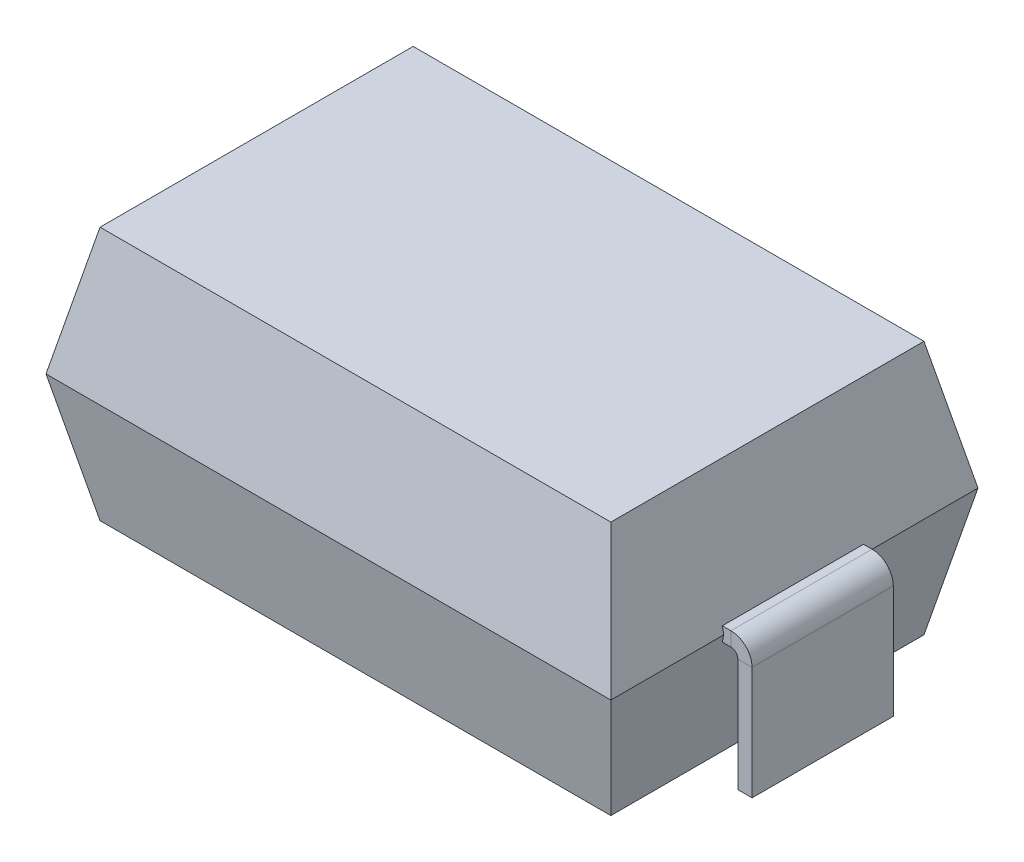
from build123d import *

# Parameters (mm, degrees)
SKETCH1_W            = 4
SKETCH1_H            = 2.6
MB_DEPTH             = 0.9
MB_TAPER             = 12
MB_OTHER_WAY_DEPTH   = 0.9
MB_OTHER_WAY_TAPER   = 12
SKETCH3_W            = 1
SKETCH3_H            = 0.1
SKETCH4_W            = 1
SKETCH4_H            = 0.1
LEG_COMPLETION_DEPTH = 0.010628


with BuildPart() as part:
    # Sketch1 → MB (new body)
    with BuildSketch(Plane(origin=(0, 0, 0), x_dir=(1, 0, 0), z_dir=(0, 1, 0))):
        Rectangle(SKETCH1_W, SKETCH1_H)
    extrude(amount=MB_DEPTH, taper=MB_TAPER)

    # Sketch1 → MB other way (add)
    with BuildSketch(Plane(origin=(0, 0, 0), x_dir=(1, 0, 0), z_dir=(0, 1, 0))):
        Rectangle(SKETCH1_W, SKETCH1_H)
    extrude(amount=-MB_OTHER_WAY_DEPTH, taper=MB_OTHER_WAY_TAPER)



with BuildPart() as body_2:
    # LEG: sweep along a path in Sketch2
    with BuildLine(Plane.XY) as leg_path:
        Line((-2.15, -0.9), (-2.15, -0.1))
        ThreePointArc((-2.15, -0.1), (-2.120710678, -0.029289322), (-2.05, 0))
        Line((-2.05, 0), (-2, 0))
    # Sketch3 → LEG (sweep)
    with BuildSketch(Plane(origin=(-2, 0, 0), x_dir=(0, 0, -1), z_dir=(1, 0, 0))):
        Rectangle(SKETCH3_W, SKETCH3_H)
    leg = sweep(path=leg_path.line)


with BuildPart() as part_1:
    add(part.part)

    add(body_2.part)  # LEG COMPLETION merges body 2
    # Sketch4 → LEG COMPLETION (add)
    with BuildSketch(Plane(origin=(-2, 0, 0), x_dir=(0, 0, -1), z_dir=(1, 0, 0))):
        Rectangle(SKETCH4_W, SKETCH4_H)
    leg_completion = extrude(amount=LEG_COMPLETION_DEPTH)

    # Mirror2: LEG, LEG COMPLETION across plane
    add(leg.mirror(Plane(origin=(0, 0, 0), x_dir=(0, 0, 1), z_dir=(1, 0, 0))))
    add(leg_completion.mirror(Plane(origin=(0, 0, 0), x_dir=(0, 0, 1), z_dir=(1, 0, 0))))


solid = part_1.part
